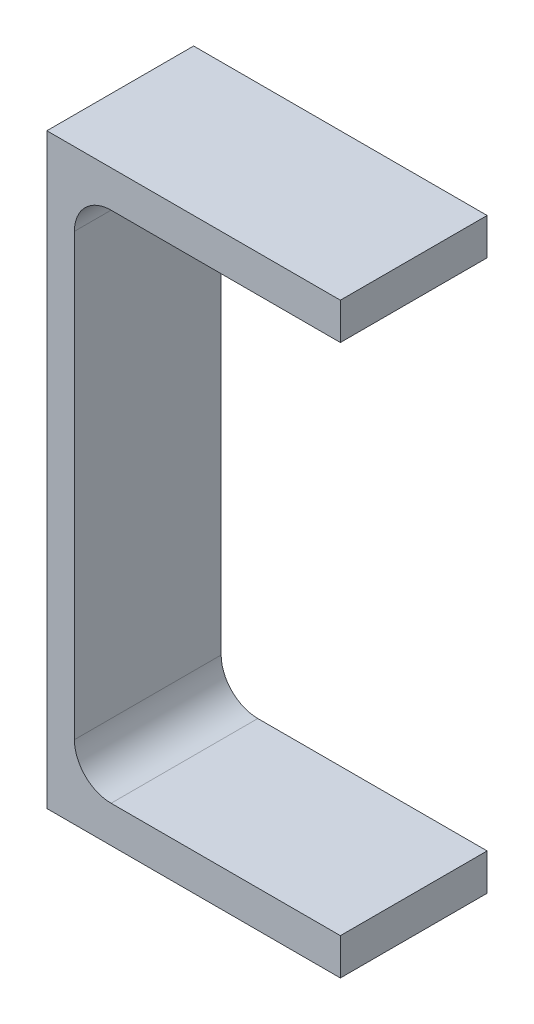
ISO-10303-21;
HEADER;
FILE_DESCRIPTION(('STEP AP214'),'2;1');
FILE_NAME('part.step','',(''),(''),'','','');
FILE_SCHEMA(('AUTOMOTIVE_DESIGN { 1 0 10303 214 1 1 1 1 }'));
ENDSEC;
DATA;
#1=APPLICATION_CONTEXT('core data for automotive mechanical design processes');
#2=APPLICATION_PROTOCOL_DEFINITION('international standard','automotive_design',2000,#1);
#3=PRODUCT_CONTEXT('',#1,'mechanical');
#4=PRODUCT('Part','Part','',(#3));
#5=PRODUCT_RELATED_PRODUCT_CATEGORY('part','',(#4));
#6=PRODUCT_DEFINITION_FORMATION('','',#4);
#7=PRODUCT_DEFINITION_CONTEXT('part definition',#1,'design');
#8=PRODUCT_DEFINITION('design','',#6,#7);
#9=PRODUCT_DEFINITION_SHAPE('','',#8);
#10=(LENGTH_UNIT() NAMED_UNIT(*) SI_UNIT(.MILLI.,.METRE.));
#11=(NAMED_UNIT(*) PLANE_ANGLE_UNIT() SI_UNIT($,.RADIAN.));
#12=(NAMED_UNIT(*) SI_UNIT($,.STERADIAN.) SOLID_ANGLE_UNIT());
#13=UNCERTAINTY_MEASURE_WITH_UNIT(LENGTH_MEASURE(1.E-05),#10,'distance_accuracy_value','');
#14=(GEOMETRIC_REPRESENTATION_CONTEXT(3) GLOBAL_UNCERTAINTY_ASSIGNED_CONTEXT((#13)) GLOBAL_UNIT_ASSIGNED_CONTEXT((#10,
#11,#12)) REPRESENTATION_CONTEXT('',''));
#15=CARTESIAN_POINT('',(0.,0.,0.));
#16=DIRECTION('',(0.,0.,1.));
#17=DIRECTION('',(1.,0.,0.));
#18=AXIS2_PLACEMENT_3D('',#15,#16,#17);
#19=CARTESIAN_POINT('',(50.7999999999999,0.,12.7));
#20=DIRECTION('',(0.,1.,0.));
#21=DIRECTION('',(0.,0.,1.));
#22=AXIS2_PLACEMENT_3D('',#19,#20,#21);
#23=PLANE('',#22);
#24=DIRECTION('',(1.,0.,0.));
#25=VECTOR('',#24,1.);
#26=CARTESIAN_POINT('',(50.7999999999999,0.,-12.7));
#27=LINE('',#26,#25);
#28=CARTESIAN_POINT('',(0.,0.,-12.7));
#29=VERTEX_POINT('',#28);
#30=CARTESIAN_POINT('',(50.7999999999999,0.,-12.7));
#31=VERTEX_POINT('',#30);
#32=EDGE_CURVE('E147',#29,#31,#27,.T.);
#33=ORIENTED_EDGE('',*,*,#32,.T.);
#34=DIRECTION('',(0.,0.,-1.));
#35=VECTOR('',#34,1.);
#36=CARTESIAN_POINT('',(50.7999999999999,0.,12.7));
#37=LINE('',#36,#35);
#38=CARTESIAN_POINT('',(50.7999999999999,0.,12.7));
#39=VERTEX_POINT('',#38);
#40=EDGE_CURVE('E11',#39,#31,#37,.T.);
#41=ORIENTED_EDGE('',*,*,#40,.F.);
#42=DIRECTION('',(1.,0.,0.));
#43=VECTOR('',#42,1.);
#44=CARTESIAN_POINT('',(50.7999999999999,0.,12.7));
#45=LINE('',#44,#43);
#46=CARTESIAN_POINT('',(0.,0.,12.7));
#47=VERTEX_POINT('',#46);
#48=EDGE_CURVE('E165',#47,#39,#45,.T.);
#49=ORIENTED_EDGE('',*,*,#48,.F.);
#50=DIRECTION('',(0.,0.,-1.));
#51=VECTOR('',#50,1.);
#52=CARTESIAN_POINT('',(0.,0.,12.7));
#53=LINE('',#52,#51);
#54=EDGE_CURVE('E143',#47,#29,#53,.T.);
#55=ORIENTED_EDGE('',*,*,#54,.T.);
#56=EDGE_LOOP('',(#33,#41,#49,#55));
#57=FACE_BOUND('',#56,.T.);
#58=ADVANCED_FACE('F39',(#57),#23,.F.);
#59=CARTESIAN_POINT('',(50.7999999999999,0.,12.7));
#60=DIRECTION('',(-1.,0.,0.));
#61=DIRECTION('',(0.,0.,1.));
#62=AXIS2_PLACEMENT_3D('',#59,#60,#61);
#63=PLANE('',#62);
#64=DIRECTION('',(0.,1.,0.));
#65=VECTOR('',#64,1.);
#66=CARTESIAN_POINT('',(50.7999999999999,0.,-12.7));
#67=LINE('',#66,#65);
#68=CARTESIAN_POINT('',(50.7999999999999,6.34999999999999,-12.7));
#69=VERTEX_POINT('',#68);
#70=EDGE_CURVE('E150',#31,#69,#67,.T.);
#71=ORIENTED_EDGE('',*,*,#70,.T.);
#72=DIRECTION('',(0.,0.,-1.));
#73=VECTOR('',#72,1.);
#74=CARTESIAN_POINT('',(50.7999999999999,6.34999999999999,12.7));
#75=LINE('',#74,#73);
#76=CARTESIAN_POINT('',(50.7999999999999,6.34999999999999,12.7));
#77=VERTEX_POINT('',#76);
#78=EDGE_CURVE('E47',#77,#69,#75,.T.);
#79=ORIENTED_EDGE('',*,*,#78,.F.);
#80=DIRECTION('',(0.,1.,0.));
#81=VECTOR('',#80,1.);
#82=CARTESIAN_POINT('',(50.7999999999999,0.,12.7));
#83=LINE('',#82,#81);
#84=EDGE_CURVE('E104',#39,#77,#83,.T.);
#85=ORIENTED_EDGE('',*,*,#84,.F.);
#86=ORIENTED_EDGE('',*,*,#40,.T.);
#87=EDGE_LOOP('',(#71,#79,#85,#86));
#88=FACE_BOUND('',#87,.T.);
#89=ADVANCED_FACE('F214',(#88),#63,.F.);
#90=CARTESIAN_POINT('',(11.1125,6.35,12.7));
#91=DIRECTION('',(0.,-1.,0.));
#92=DIRECTION('',(1.,0.,0.));
#93=AXIS2_PLACEMENT_3D('',#90,#91,#92);
#94=PLANE('',#93);
#95=DIRECTION('',(-1.,0.,0.));
#96=VECTOR('',#95,1.);
#97=CARTESIAN_POINT('',(11.1125,6.35,-12.7));
#98=LINE('',#97,#96);
#99=CARTESIAN_POINT('',(11.1125,6.34999999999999,-12.7));
#100=VERTEX_POINT('',#99);
#101=EDGE_CURVE('E152',#69,#100,#98,.T.);
#102=ORIENTED_EDGE('',*,*,#101,.T.);
#103=DIRECTION('',(0.,0.,-1.));
#104=VECTOR('',#103,1.);
#105=CARTESIAN_POINT('',(11.1125,6.34999999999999,12.7));
#106=LINE('',#105,#104);
#107=CARTESIAN_POINT('',(11.1125,6.34999999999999,12.7));
#108=VERTEX_POINT('',#107);
#109=EDGE_CURVE('E178',#108,#100,#106,.T.);
#110=ORIENTED_EDGE('',*,*,#109,.F.);
#111=DIRECTION('',(-1.,0.,0.));
#112=VECTOR('',#111,1.);
#113=CARTESIAN_POINT('',(11.1125,6.35,12.7));
#114=LINE('',#113,#112);
#115=EDGE_CURVE('E186',#77,#108,#114,.T.);
#116=ORIENTED_EDGE('',*,*,#115,.F.);
#117=ORIENTED_EDGE('',*,*,#78,.T.);
#118=EDGE_LOOP('',(#102,#110,#116,#117));
#119=FACE_BOUND('',#118,.T.);
#120=ADVANCED_FACE('F184',(#119),#94,.F.);
#121=CARTESIAN_POINT('',(11.1125,12.7,12.7));
#122=DIRECTION('',(0.,0.,-1.));
#123=DIRECTION('',(-1.,0.,0.));
#124=AXIS2_PLACEMENT_3D('',#121,#122,#123);
#125=CYLINDRICAL_SURFACE('',#124,6.35);
#126=CARTESIAN_POINT('',(11.1125,12.7,-12.7));
#127=DIRECTION('',(0.,0.,-1.));
#128=DIRECTION('',(-1.,0.,0.));
#129=AXIS2_PLACEMENT_3D('',#126,#127,#128);
#130=CIRCLE('',#129,6.35);
#131=CARTESIAN_POINT('',(4.76250000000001,12.7,-12.7));
#132=VERTEX_POINT('',#131);
#133=EDGE_CURVE('E154',#100,#132,#130,.T.);
#134=ORIENTED_EDGE('',*,*,#133,.T.);
#135=DIRECTION('',(0.,0.,-1.));
#136=VECTOR('',#135,1.);
#137=CARTESIAN_POINT('',(4.76250000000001,12.7,12.7));
#138=LINE('',#137,#136);
#139=CARTESIAN_POINT('',(4.76250000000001,12.7,12.7));
#140=VERTEX_POINT('',#139);
#141=EDGE_CURVE('E175',#140,#132,#138,.T.);
#142=ORIENTED_EDGE('',*,*,#141,.F.);
#143=CARTESIAN_POINT('',(11.1125,12.7,12.7));
#144=DIRECTION('',(0.,0.,-1.));
#145=DIRECTION('',(-1.,0.,0.));
#146=AXIS2_PLACEMENT_3D('',#143,#144,#145);
#147=CIRCLE('',#146,6.35);
#148=EDGE_CURVE('E204',#108,#140,#147,.T.);
#149=ORIENTED_EDGE('',*,*,#148,.F.);
#150=ORIENTED_EDGE('',*,*,#109,.T.);
#151=EDGE_LOOP('',(#134,#142,#149,#150));
#152=FACE_BOUND('',#151,.T.);
#153=ADVANCED_FACE('F195',(#152),#125,.F.);
#154=CARTESIAN_POINT('',(4.7625,88.9,12.7));
#155=DIRECTION('',(-1.,0.,0.));
#156=DIRECTION('',(0.,-1.,0.));
#157=AXIS2_PLACEMENT_3D('',#154,#155,#156);
#158=PLANE('',#157);
#159=DIRECTION('',(0.,1.,0.));
#160=VECTOR('',#159,1.);
#161=CARTESIAN_POINT('',(4.7625,88.9,-12.7));
#162=LINE('',#161,#160);
#163=CARTESIAN_POINT('',(4.7625,88.9,-12.7));
#164=VERTEX_POINT('',#163);
#165=EDGE_CURVE('E156',#132,#164,#162,.T.);
#166=ORIENTED_EDGE('',*,*,#165,.T.);
#167=DIRECTION('',(0.,0.,-1.));
#168=VECTOR('',#167,1.);
#169=CARTESIAN_POINT('',(4.7625,88.9,12.7));
#170=LINE('',#169,#168);
#171=CARTESIAN_POINT('',(4.7625,88.9,12.7));
#172=VERTEX_POINT('',#171);
#173=EDGE_CURVE('E172',#172,#164,#170,.T.);
#174=ORIENTED_EDGE('',*,*,#173,.F.);
#175=DIRECTION('',(0.,1.,0.));
#176=VECTOR('',#175,1.);
#177=CARTESIAN_POINT('',(4.7625,88.9,12.7));
#178=LINE('',#177,#176);
#179=EDGE_CURVE('E201',#140,#172,#178,.T.);
#180=ORIENTED_EDGE('',*,*,#179,.F.);
#181=ORIENTED_EDGE('',*,*,#141,.T.);
#182=EDGE_LOOP('',(#166,#174,#180,#181));
#183=FACE_BOUND('',#182,.T.);
#184=ADVANCED_FACE('F199',(#183),#158,.F.);
#185=CARTESIAN_POINT('',(11.1125,88.9,12.7));
#186=DIRECTION('',(0.,0.,-1.));
#187=DIRECTION('',(-1.,0.,0.));
#188=AXIS2_PLACEMENT_3D('',#185,#186,#187);
#189=CYLINDRICAL_SURFACE('',#188,6.35);
#190=CARTESIAN_POINT('',(11.1125,88.9,-12.7));
#191=DIRECTION('',(0.,0.,-1.));
#192=DIRECTION('',(-1.,0.,0.));
#193=AXIS2_PLACEMENT_3D('',#190,#191,#192);
#194=CIRCLE('',#193,6.35);
#195=CARTESIAN_POINT('',(11.1125,95.25,-12.7));
#196=VERTEX_POINT('',#195);
#197=EDGE_CURVE('E158',#164,#196,#194,.T.);
#198=ORIENTED_EDGE('',*,*,#197,.T.);
#199=DIRECTION('',(0.,0.,-1.));
#200=VECTOR('',#199,1.);
#201=CARTESIAN_POINT('',(11.1125,95.25,12.7));
#202=LINE('',#201,#200);
#203=CARTESIAN_POINT('',(11.1125,95.25,12.7));
#204=VERTEX_POINT('',#203);
#205=EDGE_CURVE('E169',#204,#196,#202,.T.);
#206=ORIENTED_EDGE('',*,*,#205,.F.);
#207=CARTESIAN_POINT('',(11.1125,88.9,12.7));
#208=DIRECTION('',(0.,0.,-1.));
#209=DIRECTION('',(-1.,0.,0.));
#210=AXIS2_PLACEMENT_3D('',#207,#208,#209);
#211=CIRCLE('',#210,6.35);
#212=EDGE_CURVE('E203',#172,#204,#211,.T.);
#213=ORIENTED_EDGE('',*,*,#212,.F.);
#214=ORIENTED_EDGE('',*,*,#173,.T.);
#215=EDGE_LOOP('',(#198,#206,#213,#214));
#216=FACE_BOUND('',#215,.T.);
#217=ADVANCED_FACE('F226',(#216),#189,.F.);
#218=CARTESIAN_POINT('',(11.1125,95.25,12.7));
#219=DIRECTION('',(0.,1.,0.));
#220=DIRECTION('',(0.,0.,1.));
#221=AXIS2_PLACEMENT_3D('',#218,#219,#220);
#222=PLANE('',#221);
#223=DIRECTION('',(1.,0.,0.));
#224=VECTOR('',#223,1.);
#225=CARTESIAN_POINT('',(11.1125,95.25,-12.7));
#226=LINE('',#225,#224);
#227=CARTESIAN_POINT('',(50.7999999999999,95.25,-12.7));
#228=VERTEX_POINT('',#227);
#229=EDGE_CURVE('E160',#196,#228,#226,.T.);
#230=ORIENTED_EDGE('',*,*,#229,.T.);
#231=DIRECTION('',(0.,0.,-1.));
#232=VECTOR('',#231,1.);
#233=CARTESIAN_POINT('',(50.7999999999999,95.25,12.7));
#234=LINE('',#233,#232);
#235=CARTESIAN_POINT('',(50.7999999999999,95.25,12.7));
#236=VERTEX_POINT('',#235);
#237=EDGE_CURVE('E138',#236,#228,#234,.T.);
#238=ORIENTED_EDGE('',*,*,#237,.F.);
#239=DIRECTION('',(1.,0.,0.));
#240=VECTOR('',#239,1.);
#241=CARTESIAN_POINT('',(11.1125,95.25,12.7));
#242=LINE('',#241,#240);
#243=EDGE_CURVE('E129',#204,#236,#242,.T.);
#244=ORIENTED_EDGE('',*,*,#243,.F.);
#245=ORIENTED_EDGE('',*,*,#205,.T.);
#246=EDGE_LOOP('',(#230,#238,#244,#245));
#247=FACE_BOUND('',#246,.T.);
#248=ADVANCED_FACE('F229',(#247),#222,.F.);
#249=CARTESIAN_POINT('',(50.7999999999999,101.6,12.7));
#250=DIRECTION('',(-1.,0.,0.));
#251=DIRECTION('',(0.,0.,1.));
#252=AXIS2_PLACEMENT_3D('',#249,#250,#251);
#253=PLANE('',#252);
#254=DIRECTION('',(0.,1.,0.));
#255=VECTOR('',#254,1.);
#256=CARTESIAN_POINT('',(50.7999999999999,101.6,-12.7));
#257=LINE('',#256,#255);
#258=CARTESIAN_POINT('',(50.7999999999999,101.6,-12.7));
#259=VERTEX_POINT('',#258);
#260=EDGE_CURVE('E137',#228,#259,#257,.T.);
#261=ORIENTED_EDGE('',*,*,#260,.T.);
#262=DIRECTION('',(0.,0.,-1.));
#263=VECTOR('',#262,1.);
#264=CARTESIAN_POINT('',(50.7999999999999,101.6,12.7));
#265=LINE('',#264,#263);
#266=CARTESIAN_POINT('',(50.7999999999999,101.6,12.7));
#267=VERTEX_POINT('',#266);
#268=EDGE_CURVE('E134',#267,#259,#265,.T.);
#269=ORIENTED_EDGE('',*,*,#268,.F.);
#270=DIRECTION('',(0.,1.,0.));
#271=VECTOR('',#270,1.);
#272=CARTESIAN_POINT('',(50.7999999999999,101.6,12.7));
#273=LINE('',#272,#271);
#274=EDGE_CURVE('E123',#236,#267,#273,.T.);
#275=ORIENTED_EDGE('',*,*,#274,.F.);
#276=ORIENTED_EDGE('',*,*,#237,.T.);
#277=EDGE_LOOP('',(#261,#269,#275,#276));
#278=FACE_BOUND('',#277,.T.);
#279=ADVANCED_FACE('F135',(#278),#253,.F.);
#280=CARTESIAN_POINT('',(50.7999999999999,101.6,12.7));
#281=DIRECTION('',(0.,-1.,0.));
#282=DIRECTION('',(0.,0.,-1.));
#283=AXIS2_PLACEMENT_3D('',#280,#281,#282);
#284=PLANE('',#283);
#285=DIRECTION('',(-1.,0.,0.));
#286=VECTOR('',#285,1.);
#287=CARTESIAN_POINT('',(50.7999999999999,101.6,-12.7));
#288=LINE('',#287,#286);
#289=CARTESIAN_POINT('',(0.,101.6,-12.7));
#290=VERTEX_POINT('',#289);
#291=EDGE_CURVE('E90',#259,#290,#288,.T.);
#292=ORIENTED_EDGE('',*,*,#291,.T.);
#293=DIRECTION('',(0.,0.,-1.));
#294=VECTOR('',#293,1.);
#295=CARTESIAN_POINT('',(0.,101.6,12.7));
#296=LINE('',#295,#294);
#297=CARTESIAN_POINT('',(0.,101.6,12.7));
#298=VERTEX_POINT('',#297);
#299=EDGE_CURVE('E139',#298,#290,#296,.T.);
#300=ORIENTED_EDGE('',*,*,#299,.F.);
#301=DIRECTION('',(-1.,0.,0.));
#302=VECTOR('',#301,1.);
#303=CARTESIAN_POINT('',(50.7999999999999,101.6,12.7));
#304=LINE('',#303,#302);
#305=EDGE_CURVE('E127',#267,#298,#304,.T.);
#306=ORIENTED_EDGE('',*,*,#305,.F.);
#307=ORIENTED_EDGE('',*,*,#268,.T.);
#308=EDGE_LOOP('',(#292,#300,#306,#307));
#309=FACE_BOUND('',#308,.T.);
#310=ADVANCED_FACE('F141',(#309),#284,.F.);
#311=CARTESIAN_POINT('',(0.,0.,12.7));
#312=DIRECTION('',(1.,0.,0.));
#313=DIRECTION('',(0.,1.,0.));
#314=AXIS2_PLACEMENT_3D('',#311,#312,#313);
#315=PLANE('',#314);
#316=DIRECTION('',(0.,-1.,0.));
#317=VECTOR('',#316,1.);
#318=CARTESIAN_POINT('',(0.,0.,-12.7));
#319=LINE('',#318,#317);
#320=EDGE_CURVE('E96',#290,#29,#319,.T.);
#321=ORIENTED_EDGE('',*,*,#320,.T.);
#322=ORIENTED_EDGE('',*,*,#54,.F.);
#323=DIRECTION('',(0.,-1.,0.));
#324=VECTOR('',#323,1.);
#325=CARTESIAN_POINT('',(0.,0.,12.7));
#326=LINE('',#325,#324);
#327=EDGE_CURVE('E55',#298,#47,#326,.T.);
#328=ORIENTED_EDGE('',*,*,#327,.F.);
#329=ORIENTED_EDGE('',*,*,#299,.T.);
#330=EDGE_LOOP('',(#321,#322,#328,#329));
#331=FACE_BOUND('',#330,.T.);
#332=ADVANCED_FACE('F238',(#331),#315,.F.);
#333=CARTESIAN_POINT('',(11.1125,88.9,12.7));
#334=DIRECTION('',(0.,0.,-1.));
#335=DIRECTION('',(-1.,0.,0.));
#336=AXIS2_PLACEMENT_3D('',#333,#334,#335);
#337=PLANE('',#336);
#338=ORIENTED_EDGE('',*,*,#48,.T.);
#339=ORIENTED_EDGE('',*,*,#84,.T.);
#340=ORIENTED_EDGE('',*,*,#115,.T.);
#341=ORIENTED_EDGE('',*,*,#148,.T.);
#342=ORIENTED_EDGE('',*,*,#179,.T.);
#343=ORIENTED_EDGE('',*,*,#212,.T.);
#344=ORIENTED_EDGE('',*,*,#243,.T.);
#345=ORIENTED_EDGE('',*,*,#274,.T.);
#346=ORIENTED_EDGE('',*,*,#305,.T.);
#347=ORIENTED_EDGE('',*,*,#327,.T.);
#348=EDGE_LOOP('',(#338,#339,#340,#341,#342,#343,#344,#345,#346,#347));
#349=FACE_BOUND('',#348,.T.);
#350=ADVANCED_FACE('F125',(#349),#337,.F.);
#351=CARTESIAN_POINT('',(11.1125,88.9,-12.7));
#352=DIRECTION('',(0.,0.,-1.));
#353=DIRECTION('',(-1.,0.,0.));
#354=AXIS2_PLACEMENT_3D('',#351,#352,#353);
#355=PLANE('',#354);
#356=ORIENTED_EDGE('',*,*,#32,.F.);
#357=ORIENTED_EDGE('',*,*,#320,.F.);
#358=ORIENTED_EDGE('',*,*,#291,.F.);
#359=ORIENTED_EDGE('',*,*,#260,.F.);
#360=ORIENTED_EDGE('',*,*,#229,.F.);
#361=ORIENTED_EDGE('',*,*,#197,.F.);
#362=ORIENTED_EDGE('',*,*,#165,.F.);
#363=ORIENTED_EDGE('',*,*,#133,.F.);
#364=ORIENTED_EDGE('',*,*,#101,.F.);
#365=ORIENTED_EDGE('',*,*,#70,.F.);
#366=EDGE_LOOP('',(#356,#357,#358,#359,#360,#361,#362,#363,#364,#365));
#367=FACE_BOUND('',#366,.T.);
#368=ADVANCED_FACE('F190',(#367),#355,.T.);
#369=CLOSED_SHELL('',(#58,#89,#120,#153,#184,#217,#248,#279,#310,#332,#350,#368));
#370=MANIFOLD_SOLID_BREP('B2',#369);
#371=ADVANCED_BREP_SHAPE_REPRESENTATION('',(#18,#370),#14);
#372=SHAPE_DEFINITION_REPRESENTATION(#9,#371);
ENDSEC;
END-ISO-10303-21;
